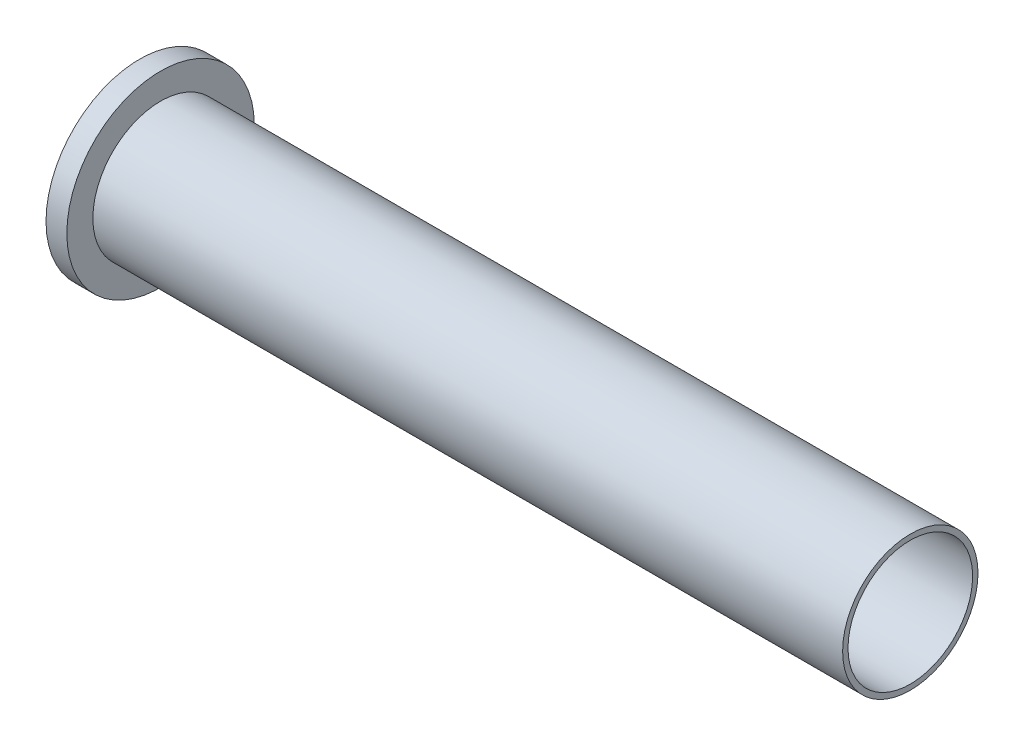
from build123d import *

# Parameters (mm, degrees)
SKETCH1_R          = 20.6375
EXTRUDE1_DEPTH     = 228.6
SKETCH2_R          = 28.575
EXTRUDE2_DEPTH     = 6.35
SKETCH3_R          = 18.9992
CUT_EXTRUDE1_DEPTH = 239.400007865


with BuildPart() as part:
    # Sketch1 → Extrude1 (new body)
    with BuildSketch(Plane(origin=(0, 0, 0), x_dir=(0, 0, -1), z_dir=(1, 0, 0))):
        Circle(SKETCH1_R)
    extrude(amount=EXTRUDE1_DEPTH)

    # Sketch2 → Extrude2 (add)
    with BuildSketch(Plane.ZY):
        Circle(SKETCH2_R)
    extrude(amount=EXTRUDE2_DEPTH)

    # Sketch3 → Cut-Extrude1 (cut, through all)
    with BuildSketch(Plane.ZY.offset(6.35)):
        Circle(SKETCH3_R)
    extrude(amount=-CUT_EXTRUDE1_DEPTH, mode=Mode.SUBTRACT)


solid = part.part
